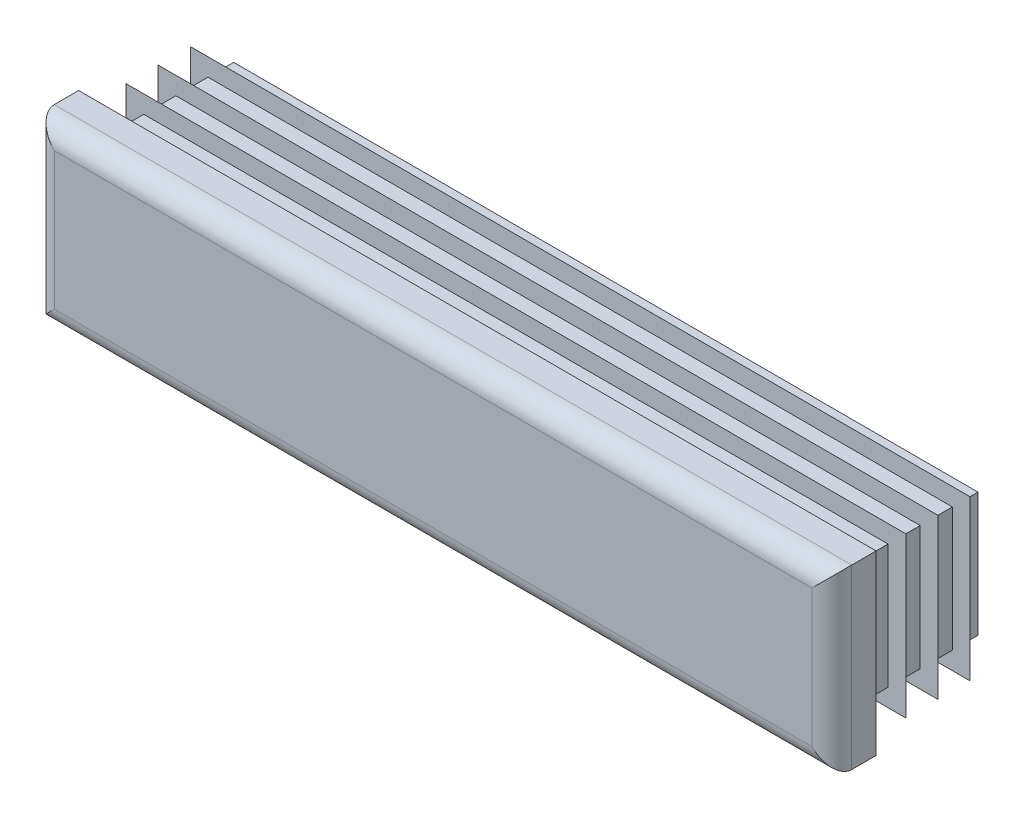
ISO-10303-21;
HEADER;
FILE_DESCRIPTION(('STEP AP214'),'2;1');
FILE_NAME('part.step','',(''),(''),'','','');
FILE_SCHEMA(('AUTOMOTIVE_DESIGN { 1 0 10303 214 1 1 1 1 }'));
ENDSEC;
DATA;
#1=APPLICATION_CONTEXT('core data for automotive mechanical design processes');
#2=APPLICATION_PROTOCOL_DEFINITION('international standard','automotive_design',2000,#1);
#3=PRODUCT_CONTEXT('',#1,'mechanical');
#4=PRODUCT('Part','Part','',(#3));
#5=PRODUCT_RELATED_PRODUCT_CATEGORY('part','',(#4));
#6=PRODUCT_DEFINITION_FORMATION('','',#4);
#7=PRODUCT_DEFINITION_CONTEXT('part definition',#1,'design');
#8=PRODUCT_DEFINITION('design','',#6,#7);
#9=PRODUCT_DEFINITION_SHAPE('','',#8);
#10=(LENGTH_UNIT() NAMED_UNIT(*) SI_UNIT(.MILLI.,.METRE.));
#11=(NAMED_UNIT(*) PLANE_ANGLE_UNIT() SI_UNIT($,.RADIAN.));
#12=(NAMED_UNIT(*) SI_UNIT($,.STERADIAN.) SOLID_ANGLE_UNIT());
#13=UNCERTAINTY_MEASURE_WITH_UNIT(LENGTH_MEASURE(1.E-05),#10,'distance_accuracy_value','');
#14=(GEOMETRIC_REPRESENTATION_CONTEXT(3) GLOBAL_UNCERTAINTY_ASSIGNED_CONTEXT((#13)) GLOBAL_UNIT_ASSIGNED_CONTEXT((#10,
#11,#12)) REPRESENTATION_CONTEXT('',''));
#15=CARTESIAN_POINT('',(0.,0.,0.));
#16=DIRECTION('',(0.,0.,1.));
#17=DIRECTION('',(1.,0.,0.));
#18=AXIS2_PLACEMENT_3D('',#15,#16,#17);
#19=CARTESIAN_POINT('',(42.75,-10.,5.));
#20=DIRECTION('',(0.,0.,-1.));
#21=DIRECTION('',(0.,1.,0.));
#22=AXIS2_PLACEMENT_3D('',#19,#20,#21);
#23=PLANE('',#22);
#24=DIRECTION('',(0.,1.,0.));
#25=VECTOR('',#24,1.);
#26=CARTESIAN_POINT('',(-42.75,-10.,5.));
#27=LINE('',#26,#25);
#28=CARTESIAN_POINT('',(-42.75,-7.75,5.));
#29=VERTEX_POINT('',#28);
#30=CARTESIAN_POINT('',(-42.75,7.75,5.));
#31=VERTEX_POINT('',#30);
#32=EDGE_CURVE('E310',#29,#31,#27,.T.);
#33=ORIENTED_EDGE('',*,*,#32,.F.);
#34=DIRECTION('',(-1.,0.,0.));
#35=VECTOR('',#34,1.);
#36=CARTESIAN_POINT('',(45.,-7.75,5.));
#37=LINE('',#36,#35);
#38=CARTESIAN_POINT('',(42.75,-7.75,5.));
#39=VERTEX_POINT('',#38);
#40=EDGE_CURVE('E482',#39,#29,#37,.T.);
#41=ORIENTED_EDGE('',*,*,#40,.F.);
#42=DIRECTION('',(0.,1.,0.));
#43=VECTOR('',#42,1.);
#44=CARTESIAN_POINT('',(42.75,-10.,5.));
#45=LINE('',#44,#43);
#46=CARTESIAN_POINT('',(42.75,7.75,5.));
#47=VERTEX_POINT('',#46);
#48=EDGE_CURVE('E305',#39,#47,#45,.T.);
#49=ORIENTED_EDGE('',*,*,#48,.T.);
#50=DIRECTION('',(-1.,0.,0.));
#51=VECTOR('',#50,1.);
#52=CARTESIAN_POINT('',(45.,7.75,5.));
#53=LINE('',#52,#51);
#54=EDGE_CURVE('E630',#47,#31,#53,.T.);
#55=ORIENTED_EDGE('',*,*,#54,.T.);
#56=EDGE_LOOP('',(#33,#41,#49,#55));
#57=FACE_BOUND('',#56,.T.);
#58=ADVANCED_FACE('F14',(#57),#23,.F.);
#59=CARTESIAN_POINT('',(-42.75,-10.,2.75));
#60=DIRECTION('',(0.,1.,0.));
#61=DIRECTION('',(-1.,0.,0.));
#62=AXIS2_PLACEMENT_3D('',#59,#60,#61);
#63=CYLINDRICAL_SURFACE('',#62,2.25);
#64=DIRECTION('',(0.,1.,0.));
#65=VECTOR('',#64,1.);
#66=CARTESIAN_POINT('',(-45.,-10.,2.75));
#67=LINE('',#66,#65);
#68=CARTESIAN_POINT('',(-45.,-10.,2.75));
#69=VERTEX_POINT('',#68);
#70=CARTESIAN_POINT('',(-45.,10.,2.75));
#71=VERTEX_POINT('',#70);
#72=EDGE_CURVE('E402',#69,#71,#67,.T.);
#73=ORIENTED_EDGE('',*,*,#72,.F.);
#74=CARTESIAN_POINT('',(-42.75,-7.75,2.75));
#75=DIRECTION('',(-0.707106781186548,0.707106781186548,0.));
#76=DIRECTION('',(0.707106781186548,0.707106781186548,0.));
#77=AXIS2_PLACEMENT_3D('',#74,#75,#76);
#78=ELLIPSE('',#77,3.18198051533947,2.25);
#79=EDGE_CURVE('E59',#69,#29,#78,.T.);
#80=ORIENTED_EDGE('',*,*,#79,.T.);
#81=ORIENTED_EDGE('',*,*,#32,.T.);
#82=CARTESIAN_POINT('',(-42.75,7.75,2.75));
#83=DIRECTION('',(0.707106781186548,0.707106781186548,0.));
#84=DIRECTION('',(-0.707106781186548,0.707106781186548,0.));
#85=AXIS2_PLACEMENT_3D('',#82,#83,#84);
#86=ELLIPSE('',#85,3.18198051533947,2.25);
#87=EDGE_CURVE('E306',#31,#71,#86,.F.);
#88=ORIENTED_EDGE('',*,*,#87,.T.);
#89=EDGE_LOOP('',(#73,#80,#81,#88));
#90=FACE_BOUND('',#89,.T.);
#91=ADVANCED_FACE('F16',(#90),#63,.T.);
#92=CARTESIAN_POINT('',(-45.,-10.,2.75));
#93=DIRECTION('',(1.,0.,0.));
#94=DIRECTION('',(0.,1.,0.));
#95=AXIS2_PLACEMENT_3D('',#92,#93,#94);
#96=PLANE('',#95);
#97=DIRECTION('',(0.,0.,-1.));
#98=VECTOR('',#97,1.);
#99=CARTESIAN_POINT('',(-45.,10.,2.75));
#100=LINE('',#99,#98);
#101=CARTESIAN_POINT('',(-45.,10.,0.));
#102=VERTEX_POINT('',#101);
#103=EDGE_CURVE('E615',#71,#102,#100,.T.);
#104=ORIENTED_EDGE('',*,*,#103,.T.);
#105=DIRECTION('',(0.,1.,0.));
#106=VECTOR('',#105,1.);
#107=CARTESIAN_POINT('',(-45.,-10.,0.));
#108=LINE('',#107,#106);
#109=CARTESIAN_POINT('',(-45.,-10.,0.));
#110=VERTEX_POINT('',#109);
#111=EDGE_CURVE('E400',#110,#102,#108,.T.);
#112=ORIENTED_EDGE('',*,*,#111,.F.);
#113=DIRECTION('',(0.,0.,-1.));
#114=VECTOR('',#113,1.);
#115=CARTESIAN_POINT('',(-45.,-10.,2.75));
#116=LINE('',#115,#114);
#117=EDGE_CURVE('E616',#69,#110,#116,.T.);
#118=ORIENTED_EDGE('',*,*,#117,.F.);
#119=ORIENTED_EDGE('',*,*,#72,.T.);
#120=EDGE_LOOP('',(#104,#112,#118,#119));
#121=FACE_BOUND('',#120,.T.);
#122=ADVANCED_FACE('F697',(#121),#96,.F.);
#123=CARTESIAN_POINT('',(-42.,-10.,0.));
#124=DIRECTION('',(1.,0.,0.));
#125=DIRECTION('',(0.,1.,0.));
#126=AXIS2_PLACEMENT_3D('',#123,#124,#125);
#127=PLANE('',#126);
#128=DIRECTION('',(0.,1.,0.));
#129=VECTOR('',#128,1.);
#130=CARTESIAN_POINT('',(-42.,-10.,0.));
#131=LINE('',#130,#129);
#132=CARTESIAN_POINT('',(-42.,-7.,0.));
#133=VERTEX_POINT('',#132);
#134=CARTESIAN_POINT('',(-42.,7.,0.));
#135=VERTEX_POINT('',#134);
#136=EDGE_CURVE('E397',#133,#135,#131,.T.);
#137=ORIENTED_EDGE('',*,*,#136,.T.);
#138=DIRECTION('',(0.,0.,-1.));
#139=VECTOR('',#138,1.);
#140=CARTESIAN_POINT('',(-42.,7.,0.));
#141=LINE('',#140,#139);
#142=CARTESIAN_POINT('',(-42.,7.,-0.725));
#143=VERTEX_POINT('',#142);
#144=EDGE_CURVE('E495',#135,#143,#141,.T.);
#145=ORIENTED_EDGE('',*,*,#144,.T.);
#146=DIRECTION('',(0.,1.,0.));
#147=VECTOR('',#146,1.);
#148=CARTESIAN_POINT('',(-42.,-10.,-0.725));
#149=LINE('',#148,#147);
#150=CARTESIAN_POINT('',(-42.,-7.,-0.725));
#151=VERTEX_POINT('',#150);
#152=EDGE_CURVE('E394',#151,#143,#149,.T.);
#153=ORIENTED_EDGE('',*,*,#152,.F.);
#154=DIRECTION('',(0.,0.,1.));
#155=VECTOR('',#154,1.);
#156=CARTESIAN_POINT('',(-42.,-7.,0.));
#157=LINE('',#156,#155);
#158=EDGE_CURVE('E489',#151,#133,#157,.T.);
#159=ORIENTED_EDGE('',*,*,#158,.T.);
#160=EDGE_LOOP('',(#137,#145,#153,#159));
#161=FACE_BOUND('',#160,.T.);
#162=ADVANCED_FACE('F787',(#161),#127,.F.);
#163=CARTESIAN_POINT('',(-44.,-10.,-0.725));
#164=DIRECTION('',(0.34202014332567,0.,0.939692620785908));
#165=DIRECTION('',(-0.939692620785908,0.,0.34202014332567));
#166=AXIS2_PLACEMENT_3D('',#163,#164,#165);
#167=PLANE('',#166);
#168=DIRECTION('',(0.,1.,0.));
#169=VECTOR('',#168,1.);
#170=CARTESIAN_POINT('',(-44.,-10.,-0.725));
#171=LINE('',#170,#169);
#172=CARTESIAN_POINT('',(-44.,-9.,-0.725));
#173=VERTEX_POINT('',#172);
#174=CARTESIAN_POINT('',(-44.,9.,-0.725));
#175=VERTEX_POINT('',#174);
#176=EDGE_CURVE('E392',#173,#175,#171,.T.);
#177=ORIENTED_EDGE('',*,*,#176,.T.);
#178=DIRECTION('',(0.844349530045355,-0.438895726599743,-0.307318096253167));
#179=VECTOR('',#178,1.);
#180=CARTESIAN_POINT('',(-36.9589533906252,5.3400402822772,-3.28773138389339));
#181=LINE('',#180,#179);
#182=CARTESIAN_POINT('',(-42.,7.96039327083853,-1.4529404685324));
#183=VERTEX_POINT('',#182);
#184=EDGE_CURVE('E519',#175,#183,#181,.T.);
#185=ORIENTED_EDGE('',*,*,#184,.T.);
#186=DIRECTION('',(0.,1.,0.));
#187=VECTOR('',#186,1.);
#188=CARTESIAN_POINT('',(-42.,-10.,-1.4529404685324));
#189=LINE('',#188,#187);
#190=CARTESIAN_POINT('',(-42.,-7.96039327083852,-1.4529404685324));
#191=VERTEX_POINT('',#190);
#192=EDGE_CURVE('E389',#191,#183,#189,.T.);
#193=ORIENTED_EDGE('',*,*,#192,.F.);
#194=DIRECTION('',(-0.844349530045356,-0.438895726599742,0.307318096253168));
#195=VECTOR('',#194,1.);
#196=CARTESIAN_POINT('',(-44.3705814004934,-9.19262945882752,-0.590119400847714));
#197=LINE('',#196,#195);
#198=EDGE_CURVE('E507',#191,#173,#197,.T.);
#199=ORIENTED_EDGE('',*,*,#198,.T.);
#200=EDGE_LOOP('',(#177,#185,#193,#199));
#201=FACE_BOUND('',#200,.T.);
#202=ADVANCED_FACE('F783',(#201),#167,.F.);
#203=CARTESIAN_POINT('',(-42.,-10.,-1.4529404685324));
#204=DIRECTION('',(1.,0.,0.));
#205=DIRECTION('',(0.,1.,0.));
#206=AXIS2_PLACEMENT_3D('',#203,#204,#205);
#207=PLANE('',#206);
#208=ORIENTED_EDGE('',*,*,#192,.T.);
#209=DIRECTION('',(0.,-0.819152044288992,-0.573576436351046));
#210=VECTOR('',#209,1.);
#211=CARTESIAN_POINT('',(-42.,-4.09121150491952,-9.89156498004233));
#212=LINE('',#211,#210);
#213=CARTESIAN_POINT('',(-42.,7.,-2.12541507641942));
#214=VERTEX_POINT('',#213);
#215=EDGE_CURVE('E516',#183,#214,#212,.T.);
#216=ORIENTED_EDGE('',*,*,#215,.T.);
#217=DIRECTION('',(0.,0.,-1.));
#218=VECTOR('',#217,1.);
#219=CARTESIAN_POINT('',(-42.,7.,-1.4529404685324));
#220=LINE('',#219,#218);
#221=CARTESIAN_POINT('',(-42.,7.,-4.35));
#222=VERTEX_POINT('',#221);
#223=EDGE_CURVE('E525',#214,#222,#220,.T.);
#224=ORIENTED_EDGE('',*,*,#223,.T.);
#225=DIRECTION('',(0.,1.,0.));
#226=VECTOR('',#225,1.);
#227=CARTESIAN_POINT('',(-42.,-10.,-4.35));
#228=LINE('',#227,#226);
#229=CARTESIAN_POINT('',(-42.,-7.,-4.35));
#230=VERTEX_POINT('',#229);
#231=EDGE_CURVE('E386',#230,#222,#228,.T.);
#232=ORIENTED_EDGE('',*,*,#231,.F.);
#233=DIRECTION('',(0.,0.,1.));
#234=VECTOR('',#233,1.);
#235=CARTESIAN_POINT('',(-42.,-7.,-1.4529404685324));
#236=LINE('',#235,#234);
#237=CARTESIAN_POINT('',(-42.,-7.,-2.12541507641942));
#238=VERTEX_POINT('',#237);
#239=EDGE_CURVE('E522',#230,#238,#236,.T.);
#240=ORIENTED_EDGE('',*,*,#239,.T.);
#241=DIRECTION('',(0.,-0.819152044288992,0.573576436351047));
#242=VECTOR('',#241,1.);
#243=CARTESIAN_POINT('',(-42.,-9.32898992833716,-0.494638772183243));
#244=LINE('',#243,#242);
#245=EDGE_CURVE('E504',#238,#191,#244,.T.);
#246=ORIENTED_EDGE('',*,*,#245,.T.);
#247=EDGE_LOOP('',(#208,#216,#224,#232,#240,#246));
#248=FACE_BOUND('',#247,.T.);
#249=ADVANCED_FACE('F779',(#248),#207,.F.);
#250=CARTESIAN_POINT('',(-44.,-10.,-4.35));
#251=DIRECTION('',(0.342020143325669,0.,0.939692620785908));
#252=DIRECTION('',(-0.939692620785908,0.,0.342020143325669));
#253=AXIS2_PLACEMENT_3D('',#250,#251,#252);
#254=PLANE('',#253);
#255=DIRECTION('',(0.,1.,0.));
#256=VECTOR('',#255,1.);
#257=CARTESIAN_POINT('',(-44.,-10.,-4.35));
#258=LINE('',#257,#256);
#259=CARTESIAN_POINT('',(-44.,-9.,-4.35));
#260=VERTEX_POINT('',#259);
#261=CARTESIAN_POINT('',(-44.,9.,-4.35));
#262=VERTEX_POINT('',#261);
#263=EDGE_CURVE('E384',#260,#262,#258,.T.);
#264=ORIENTED_EDGE('',*,*,#263,.T.);
#265=DIRECTION('',(0.844349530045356,-0.438895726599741,-0.307318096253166));
#266=VECTOR('',#265,1.);
#267=CARTESIAN_POINT('',(-36.9589533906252,5.34004028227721,-6.91273138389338));
#268=LINE('',#267,#266);
#269=CARTESIAN_POINT('',(-42.,7.96039327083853,-5.0779404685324));
#270=VERTEX_POINT('',#269);
#271=EDGE_CURVE('E549',#262,#270,#268,.T.);
#272=ORIENTED_EDGE('',*,*,#271,.T.);
#273=DIRECTION('',(0.,1.,0.));
#274=VECTOR('',#273,1.);
#275=CARTESIAN_POINT('',(-42.,-10.,-5.0779404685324));
#276=LINE('',#275,#274);
#277=CARTESIAN_POINT('',(-42.,-7.96039327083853,-5.0779404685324));
#278=VERTEX_POINT('',#277);
#279=EDGE_CURVE('E381',#278,#270,#276,.T.);
#280=ORIENTED_EDGE('',*,*,#279,.F.);
#281=DIRECTION('',(-0.844349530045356,-0.438895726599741,0.307318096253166));
#282=VECTOR('',#281,1.);
#283=CARTESIAN_POINT('',(-44.3705814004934,-9.19262945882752,-4.21511940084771));
#284=LINE('',#283,#282);
#285=EDGE_CURVE('E537',#278,#260,#284,.T.);
#286=ORIENTED_EDGE('',*,*,#285,.T.);
#287=EDGE_LOOP('',(#264,#272,#280,#286));
#288=FACE_BOUND('',#287,.T.);
#289=ADVANCED_FACE('F775',(#288),#254,.F.);
#290=CARTESIAN_POINT('',(-42.,-10.,-5.0779404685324));
#291=DIRECTION('',(1.,0.,0.));
#292=DIRECTION('',(0.,1.,0.));
#293=AXIS2_PLACEMENT_3D('',#290,#291,#292);
#294=PLANE('',#293);
#295=ORIENTED_EDGE('',*,*,#279,.T.);
#296=DIRECTION('',(0.,-0.819152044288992,-0.573576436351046));
#297=VECTOR('',#296,1.);
#298=CARTESIAN_POINT('',(-42.,-4.09121150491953,-13.5165649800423));
#299=LINE('',#298,#297);
#300=CARTESIAN_POINT('',(-42.,7.,-5.75041507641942));
#301=VERTEX_POINT('',#300);
#302=EDGE_CURVE('E546',#270,#301,#299,.T.);
#303=ORIENTED_EDGE('',*,*,#302,.T.);
#304=DIRECTION('',(0.,0.,-1.));
#305=VECTOR('',#304,1.);
#306=CARTESIAN_POINT('',(-42.,7.,-5.0779404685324));
#307=LINE('',#306,#305);
#308=CARTESIAN_POINT('',(-42.,7.,-7.975));
#309=VERTEX_POINT('',#308);
#310=EDGE_CURVE('E555',#301,#309,#307,.T.);
#311=ORIENTED_EDGE('',*,*,#310,.T.);
#312=DIRECTION('',(0.,1.,0.));
#313=VECTOR('',#312,1.);
#314=CARTESIAN_POINT('',(-42.,-10.,-7.975));
#315=LINE('',#314,#313);
#316=CARTESIAN_POINT('',(-42.,-7.,-7.975));
#317=VERTEX_POINT('',#316);
#318=EDGE_CURVE('E378',#317,#309,#315,.T.);
#319=ORIENTED_EDGE('',*,*,#318,.F.);
#320=DIRECTION('',(0.,0.,1.));
#321=VECTOR('',#320,1.);
#322=CARTESIAN_POINT('',(-42.,-7.,-5.0779404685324));
#323=LINE('',#322,#321);
#324=CARTESIAN_POINT('',(-42.,-7.,-5.75041507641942));
#325=VERTEX_POINT('',#324);
#326=EDGE_CURVE('E552',#317,#325,#323,.T.);
#327=ORIENTED_EDGE('',*,*,#326,.T.);
#328=DIRECTION('',(0.,-0.819152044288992,0.573576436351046));
#329=VECTOR('',#328,1.);
#330=CARTESIAN_POINT('',(-42.,-9.32898992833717,-4.11963877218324));
#331=LINE('',#330,#329);
#332=EDGE_CURVE('E534',#325,#278,#331,.T.);
#333=ORIENTED_EDGE('',*,*,#332,.T.);
#334=EDGE_LOOP('',(#295,#303,#311,#319,#327,#333));
#335=FACE_BOUND('',#334,.T.);
#336=ADVANCED_FACE('F771',(#335),#294,.F.);
#337=CARTESIAN_POINT('',(-44.,-10.,-7.975));
#338=DIRECTION('',(0.342020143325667,0.,0.939692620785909));
#339=DIRECTION('',(-0.939692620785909,0.,0.342020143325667));
#340=AXIS2_PLACEMENT_3D('',#337,#338,#339);
#341=PLANE('',#340);
#342=DIRECTION('',(0.,1.,0.));
#343=VECTOR('',#342,1.);
#344=CARTESIAN_POINT('',(-44.,-10.,-7.975));
#345=LINE('',#344,#343);
#346=CARTESIAN_POINT('',(-44.,-9.,-7.975));
#347=VERTEX_POINT('',#346);
#348=CARTESIAN_POINT('',(-44.,9.,-7.975));
#349=VERTEX_POINT('',#348);
#350=EDGE_CURVE('E376',#347,#349,#345,.T.);
#351=ORIENTED_EDGE('',*,*,#350,.T.);
#352=DIRECTION('',(0.844349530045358,-0.43889572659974,-0.307318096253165));
#353=VECTOR('',#352,1.);
#354=CARTESIAN_POINT('',(-36.9589533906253,5.34004028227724,-10.5377313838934));
#355=LINE('',#354,#353);
#356=CARTESIAN_POINT('',(-42.,7.96039327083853,-8.7029404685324));
#357=VERTEX_POINT('',#356);
#358=EDGE_CURVE('E579',#349,#357,#355,.T.);
#359=ORIENTED_EDGE('',*,*,#358,.T.);
#360=DIRECTION('',(0.,1.,0.));
#361=VECTOR('',#360,1.);
#362=CARTESIAN_POINT('',(-42.,-10.,-8.7029404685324));
#363=LINE('',#362,#361);
#364=CARTESIAN_POINT('',(-42.,-7.96039327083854,-8.7029404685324));
#365=VERTEX_POINT('',#364);
#366=EDGE_CURVE('E373',#365,#357,#363,.T.);
#367=ORIENTED_EDGE('',*,*,#366,.F.);
#368=DIRECTION('',(-0.844349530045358,-0.438895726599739,0.307318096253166));
#369=VECTOR('',#368,1.);
#370=CARTESIAN_POINT('',(-44.3705814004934,-9.19262945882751,-7.84011940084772));
#371=LINE('',#370,#369);
#372=EDGE_CURVE('E567',#365,#347,#371,.T.);
#373=ORIENTED_EDGE('',*,*,#372,.T.);
#374=EDGE_LOOP('',(#351,#359,#367,#373));
#375=FACE_BOUND('',#374,.T.);
#376=ADVANCED_FACE('F767',(#375),#341,.F.);
#377=CARTESIAN_POINT('',(-42.,-10.,-8.7029404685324));
#378=DIRECTION('',(1.,0.,0.));
#379=DIRECTION('',(0.,1.,0.));
#380=AXIS2_PLACEMENT_3D('',#377,#378,#379);
#381=PLANE('',#380);
#382=ORIENTED_EDGE('',*,*,#366,.T.);
#383=DIRECTION('',(0.,-0.819152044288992,-0.573576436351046));
#384=VECTOR('',#383,1.);
#385=CARTESIAN_POINT('',(-42.,-4.09121150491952,-17.1415649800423));
#386=LINE('',#385,#384);
#387=CARTESIAN_POINT('',(-42.,7.,-9.37541507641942));
#388=VERTEX_POINT('',#387);
#389=EDGE_CURVE('E576',#357,#388,#386,.T.);
#390=ORIENTED_EDGE('',*,*,#389,.T.);
#391=DIRECTION('',(0.,0.,-1.));
#392=VECTOR('',#391,1.);
#393=CARTESIAN_POINT('',(-42.,7.,-8.7029404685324));
#394=LINE('',#393,#392);
#395=CARTESIAN_POINT('',(-42.,7.,-11.6));
#396=VERTEX_POINT('',#395);
#397=EDGE_CURVE('E585',#388,#396,#394,.T.);
#398=ORIENTED_EDGE('',*,*,#397,.T.);
#399=DIRECTION('',(0.,1.,0.));
#400=VECTOR('',#399,1.);
#401=CARTESIAN_POINT('',(-42.,-10.,-11.6));
#402=LINE('',#401,#400);
#403=CARTESIAN_POINT('',(-42.,-7.,-11.6));
#404=VERTEX_POINT('',#403);
#405=EDGE_CURVE('E370',#404,#396,#402,.T.);
#406=ORIENTED_EDGE('',*,*,#405,.F.);
#407=DIRECTION('',(0.,0.,1.));
#408=VECTOR('',#407,1.);
#409=CARTESIAN_POINT('',(-42.,-7.,-8.7029404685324));
#410=LINE('',#409,#408);
#411=CARTESIAN_POINT('',(-42.,-7.,-9.37541507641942));
#412=VERTEX_POINT('',#411);
#413=EDGE_CURVE('E582',#404,#412,#410,.T.);
#414=ORIENTED_EDGE('',*,*,#413,.T.);
#415=DIRECTION('',(0.,-0.819152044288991,0.573576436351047));
#416=VECTOR('',#415,1.);
#417=CARTESIAN_POINT('',(-42.,-9.32898992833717,-7.74463877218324));
#418=LINE('',#417,#416);
#419=EDGE_CURVE('E564',#412,#365,#418,.T.);
#420=ORIENTED_EDGE('',*,*,#419,.T.);
#421=EDGE_LOOP('',(#382,#390,#398,#406,#414,#420));
#422=FACE_BOUND('',#421,.T.);
#423=ADVANCED_FACE('F764',(#422),#381,.F.);
#424=CARTESIAN_POINT('',(-44.,-10.,-11.6));
#425=DIRECTION('',(0.342020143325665,0.,0.93969262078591));
#426=DIRECTION('',(-0.93969262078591,0.,0.342020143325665));
#427=AXIS2_PLACEMENT_3D('',#424,#425,#426);
#428=PLANE('',#427);
#429=DIRECTION('',(0.,1.,0.));
#430=VECTOR('',#429,1.);
#431=CARTESIAN_POINT('',(-44.,-10.,-11.6));
#432=LINE('',#431,#430);
#433=CARTESIAN_POINT('',(-44.,-9.,-11.6));
#434=VERTEX_POINT('',#433);
#435=CARTESIAN_POINT('',(-44.,9.,-11.6));
#436=VERTEX_POINT('',#435);
#437=EDGE_CURVE('E368',#434,#436,#432,.T.);
#438=ORIENTED_EDGE('',*,*,#437,.T.);
#439=DIRECTION('',(0.844349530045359,-0.438895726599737,-0.307318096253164));
#440=VECTOR('',#439,1.);
#441=CARTESIAN_POINT('',(-36.9589533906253,5.34004028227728,-14.1627313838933));
#442=LINE('',#441,#440);
#443=CARTESIAN_POINT('',(-42.,7.96039327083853,-12.3279404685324));
#444=VERTEX_POINT('',#443);
#445=EDGE_CURVE('E607',#436,#444,#442,.T.);
#446=ORIENTED_EDGE('',*,*,#445,.T.);
#447=DIRECTION('',(0.,1.,0.));
#448=VECTOR('',#447,1.);
#449=CARTESIAN_POINT('',(-42.,-10.,-12.3279404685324));
#450=LINE('',#449,#448);
#451=CARTESIAN_POINT('',(-42.,-7.96039327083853,-12.3279404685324));
#452=VERTEX_POINT('',#451);
#453=EDGE_CURVE('E365',#452,#444,#450,.T.);
#454=ORIENTED_EDGE('',*,*,#453,.F.);
#455=DIRECTION('',(-0.844349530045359,-0.438895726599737,0.307318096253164));
#456=VECTOR('',#455,1.);
#457=CARTESIAN_POINT('',(-44.3705814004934,-9.19262945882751,-11.4651194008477));
#458=LINE('',#457,#456);
#459=EDGE_CURVE('E595',#452,#434,#458,.T.);
#460=ORIENTED_EDGE('',*,*,#459,.T.);
#461=EDGE_LOOP('',(#438,#446,#454,#460));
#462=FACE_BOUND('',#461,.T.);
#463=ADVANCED_FACE('F675',(#462),#428,.F.);
#464=CARTESIAN_POINT('',(-42.,-10.,-12.3279404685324));
#465=DIRECTION('',(1.,0.,0.));
#466=DIRECTION('',(0.,1.,0.));
#467=AXIS2_PLACEMENT_3D('',#464,#465,#466);
#468=PLANE('',#467);
#469=ORIENTED_EDGE('',*,*,#453,.T.);
#470=DIRECTION('',(0.,-0.819152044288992,-0.573576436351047));
#471=VECTOR('',#470,1.);
#472=CARTESIAN_POINT('',(-42.,-4.09121150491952,-20.7665649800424));
#473=LINE('',#472,#471);
#474=CARTESIAN_POINT('',(-42.,7.,-13.0004150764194));
#475=VERTEX_POINT('',#474);
#476=EDGE_CURVE('E604',#444,#475,#473,.T.);
#477=ORIENTED_EDGE('',*,*,#476,.T.);
#478=DIRECTION('',(0.,0.,-1.));
#479=VECTOR('',#478,1.);
#480=CARTESIAN_POINT('',(-42.,7.,-12.3279404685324));
#481=LINE('',#480,#479);
#482=CARTESIAN_POINT('',(-42.,7.,-14.5));
#483=VERTEX_POINT('',#482);
#484=EDGE_CURVE('E613',#475,#483,#481,.T.);
#485=ORIENTED_EDGE('',*,*,#484,.T.);
#486=DIRECTION('',(0.,1.,0.));
#487=VECTOR('',#486,1.);
#488=CARTESIAN_POINT('',(-42.,-10.,-14.5));
#489=LINE('',#488,#487);
#490=CARTESIAN_POINT('',(-42.,-7.,-14.5));
#491=VERTEX_POINT('',#490);
#492=EDGE_CURVE('E362',#491,#483,#489,.T.);
#493=ORIENTED_EDGE('',*,*,#492,.F.);
#494=DIRECTION('',(0.,0.,1.));
#495=VECTOR('',#494,1.);
#496=CARTESIAN_POINT('',(-42.,-7.,-12.3279404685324));
#497=LINE('',#496,#495);
#498=CARTESIAN_POINT('',(-42.,-7.,-13.0004150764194));
#499=VERTEX_POINT('',#498);
#500=EDGE_CURVE('E610',#491,#499,#497,.T.);
#501=ORIENTED_EDGE('',*,*,#500,.T.);
#502=DIRECTION('',(0.,-0.819152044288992,0.573576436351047));
#503=VECTOR('',#502,1.);
#504=CARTESIAN_POINT('',(-42.,-9.32898992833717,-11.3696387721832));
#505=LINE('',#504,#503);
#506=EDGE_CURVE('E592',#499,#452,#505,.T.);
#507=ORIENTED_EDGE('',*,*,#506,.T.);
#508=EDGE_LOOP('',(#469,#477,#485,#493,#501,#507));
#509=FACE_BOUND('',#508,.T.);
#510=ADVANCED_FACE('F677',(#509),#468,.F.);
#511=CARTESIAN_POINT('',(-42.,-10.,-14.5));
#512=DIRECTION('',(0.,0.,1.));
#513=DIRECTION('',(0.,-1.,0.));
#514=AXIS2_PLACEMENT_3D('',#511,#512,#513);
#515=PLANE('',#514);
#516=ORIENTED_EDGE('',*,*,#492,.T.);
#517=DIRECTION('',(-1.,0.,0.));
#518=VECTOR('',#517,1.);
#519=CARTESIAN_POINT('',(45.,7.,-14.5));
#520=LINE('',#519,#518);
#521=CARTESIAN_POINT('',(42.,7.,-14.5));
#522=VERTEX_POINT('',#521);
#523=EDGE_CURVE('E438',#522,#483,#520,.T.);
#524=ORIENTED_EDGE('',*,*,#523,.F.);
#525=DIRECTION('',(0.,1.,0.));
#526=VECTOR('',#525,1.);
#527=CARTESIAN_POINT('',(42.,-10.,-14.5));
#528=LINE('',#527,#526);
#529=CARTESIAN_POINT('',(42.,-7.,-14.5));
#530=VERTEX_POINT('',#529);
#531=EDGE_CURVE('E359',#530,#522,#528,.T.);
#532=ORIENTED_EDGE('',*,*,#531,.F.);
#533=DIRECTION('',(-1.,0.,0.));
#534=VECTOR('',#533,1.);
#535=CARTESIAN_POINT('',(45.,-7.,-14.5));
#536=LINE('',#535,#534);
#537=EDGE_CURVE('E436',#530,#491,#536,.T.);
#538=ORIENTED_EDGE('',*,*,#537,.T.);
#539=EDGE_LOOP('',(#516,#524,#532,#538));
#540=FACE_BOUND('',#539,.T.);
#541=ADVANCED_FACE('F435',(#540),#515,.F.);
#542=CARTESIAN_POINT('',(42.,-10.,-14.5));
#543=DIRECTION('',(-1.,0.,0.));
#544=DIRECTION('',(0.,-1.,0.));
#545=AXIS2_PLACEMENT_3D('',#542,#543,#544);
#546=PLANE('',#545);
#547=DIRECTION('',(0.,0.,1.));
#548=VECTOR('',#547,1.);
#549=CARTESIAN_POINT('',(42.,7.,-14.5));
#550=LINE('',#549,#548);
#551=CARTESIAN_POINT('',(42.,7.,-13.0004150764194));
#552=VERTEX_POINT('',#551);
#553=EDGE_CURVE('E9',#522,#552,#550,.T.);
#554=ORIENTED_EDGE('',*,*,#553,.T.);
#555=DIRECTION('',(0.,0.819152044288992,0.573576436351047));
#556=VECTOR('',#555,1.);
#557=CARTESIAN_POINT('',(42.,-5.11174566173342,-21.4811506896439));
#558=LINE('',#557,#556);
#559=CARTESIAN_POINT('',(42.,7.96039327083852,-12.3279404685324));
#560=VERTEX_POINT('',#559);
#561=EDGE_CURVE('E601',#552,#560,#558,.T.);
#562=ORIENTED_EDGE('',*,*,#561,.T.);
#563=DIRECTION('',(0.,1.,0.));
#564=VECTOR('',#563,1.);
#565=CARTESIAN_POINT('',(42.,-10.,-12.3279404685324));
#566=LINE('',#565,#564);
#567=CARTESIAN_POINT('',(42.,-7.96039327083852,-12.3279404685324));
#568=VERTEX_POINT('',#567);
#569=EDGE_CURVE('E356',#568,#560,#566,.T.);
#570=ORIENTED_EDGE('',*,*,#569,.F.);
#571=DIRECTION('',(0.,0.819152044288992,-0.573576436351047));
#572=VECTOR('',#571,1.);
#573=CARTESIAN_POINT('',(42.,-8.30845577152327,-12.0842244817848));
#574=LINE('',#573,#572);
#575=CARTESIAN_POINT('',(42.,-7.,-13.0004150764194));
#576=VERTEX_POINT('',#575);
#577=EDGE_CURVE('E428',#568,#576,#574,.T.);
#578=ORIENTED_EDGE('',*,*,#577,.T.);
#579=DIRECTION('',(0.,0.,-1.));
#580=VECTOR('',#579,1.);
#581=CARTESIAN_POINT('',(42.,-7.,-14.5));
#582=LINE('',#581,#580);
#583=EDGE_CURVE('E23',#576,#530,#582,.T.);
#584=ORIENTED_EDGE('',*,*,#583,.T.);
#585=ORIENTED_EDGE('',*,*,#531,.T.);
#586=EDGE_LOOP('',(#554,#562,#570,#578,#584,#585));
#587=FACE_BOUND('',#586,.T.);
#588=ADVANCED_FACE('F426',(#587),#546,.F.);
#589=CARTESIAN_POINT('',(42.,-10.,-12.3279404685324));
#590=DIRECTION('',(-0.342020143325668,0.,0.939692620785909));
#591=DIRECTION('',(-0.939692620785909,0.,-0.342020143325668));
#592=AXIS2_PLACEMENT_3D('',#589,#590,#591);
#593=PLANE('',#592);
#594=ORIENTED_EDGE('',*,*,#569,.T.);
#595=DIRECTION('',(0.844349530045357,0.43889572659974,0.307318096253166));
#596=VECTOR('',#595,1.);
#597=CARTESIAN_POINT('',(35.3442123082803,4.50069243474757,-14.7504490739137));
#598=LINE('',#597,#596);
#599=CARTESIAN_POINT('',(44.,9.,-11.6));
#600=VERTEX_POINT('',#599);
#601=EDGE_CURVE('E598',#560,#600,#598,.T.);
#602=ORIENTED_EDGE('',*,*,#601,.T.);
#603=DIRECTION('',(0.,1.,0.));
#604=VECTOR('',#603,1.);
#605=CARTESIAN_POINT('',(44.,-10.,-11.6));
#606=LINE('',#605,#604);
#607=CARTESIAN_POINT('',(44.,-9.,-11.6));
#608=VERTEX_POINT('',#607);
#609=EDGE_CURVE('E353',#608,#600,#606,.T.);
#610=ORIENTED_EDGE('',*,*,#609,.F.);
#611=DIRECTION('',(-0.844349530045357,0.43889572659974,-0.307318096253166));
#612=VECTOR('',#611,1.);
#613=CARTESIAN_POINT('',(42.7558403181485,-8.35328161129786,-12.0528370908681));
#614=LINE('',#613,#612);
#615=EDGE_CURVE('E588',#608,#568,#614,.T.);
#616=ORIENTED_EDGE('',*,*,#615,.T.);
#617=EDGE_LOOP('',(#594,#602,#610,#616));
#618=FACE_BOUND('',#617,.T.);
#619=ADVANCED_FACE('F752',(#618),#593,.F.);
#620=CARTESIAN_POINT('',(44.,-10.,-11.6));
#621=DIRECTION('',(0.,0.,-1.));
#622=DIRECTION('',(0.,1.,0.));
#623=AXIS2_PLACEMENT_3D('',#620,#621,#622);
#624=PLANE('',#623);
#625=ORIENTED_EDGE('',*,*,#609,.T.);
#626=DIRECTION('',(-1.,0.,0.));
#627=VECTOR('',#626,1.);
#628=CARTESIAN_POINT('',(45.,9.,-11.6));
#629=LINE('',#628,#627);
#630=EDGE_CURVE('E444',#600,#436,#629,.T.);
#631=ORIENTED_EDGE('',*,*,#630,.T.);
#632=ORIENTED_EDGE('',*,*,#437,.F.);
#633=DIRECTION('',(-1.,0.,0.));
#634=VECTOR('',#633,1.);
#635=CARTESIAN_POINT('',(45.,-9.,-11.6));
#636=LINE('',#635,#634);
#637=EDGE_CURVE('E451',#608,#434,#636,.T.);
#638=ORIENTED_EDGE('',*,*,#637,.F.);
#639=EDGE_LOOP('',(#625,#631,#632,#638));
#640=FACE_BOUND('',#639,.T.);
#641=ORIENTED_EDGE('',*,*,#405,.T.);
#642=DIRECTION('',(-1.,0.,0.));
#643=VECTOR('',#642,1.);
#644=CARTESIAN_POINT('',(45.,7.,-11.6));
#645=LINE('',#644,#643);
#646=CARTESIAN_POINT('',(42.,7.,-11.6));
#647=VERTEX_POINT('',#646);
#648=EDGE_CURVE('E663',#647,#396,#645,.T.);
#649=ORIENTED_EDGE('',*,*,#648,.F.);
#650=DIRECTION('',(0.,1.,0.));
#651=VECTOR('',#650,1.);
#652=CARTESIAN_POINT('',(42.,-10.,-11.6));
#653=LINE('',#652,#651);
#654=CARTESIAN_POINT('',(42.,-7.,-11.6));
#655=VERTEX_POINT('',#654);
#656=EDGE_CURVE('E350',#655,#647,#653,.T.);
#657=ORIENTED_EDGE('',*,*,#656,.F.);
#658=DIRECTION('',(-1.,0.,0.));
#659=VECTOR('',#658,1.);
#660=CARTESIAN_POINT('',(45.,-7.,-11.6));
#661=LINE('',#660,#659);
#662=EDGE_CURVE('E453',#655,#404,#661,.T.);
#663=ORIENTED_EDGE('',*,*,#662,.T.);
#664=EDGE_LOOP('',(#641,#649,#657,#663));
#665=FACE_BOUND('',#664,.T.);
#666=ADVANCED_FACE('F667',(#640,#665),#624,.F.);
#667=CARTESIAN_POINT('',(42.,-10.,-11.6));
#668=DIRECTION('',(-1.,0.,0.));
#669=DIRECTION('',(0.,-1.,0.));
#670=AXIS2_PLACEMENT_3D('',#667,#668,#669);
#671=PLANE('',#670);
#672=DIRECTION('',(0.,0.,1.));
#673=VECTOR('',#672,1.);
#674=CARTESIAN_POINT('',(42.,7.,-11.6));
#675=LINE('',#674,#673);
#676=CARTESIAN_POINT('',(42.,7.,-9.37541507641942));
#677=VERTEX_POINT('',#676);
#678=EDGE_CURVE('E420',#647,#677,#675,.T.);
#679=ORIENTED_EDGE('',*,*,#678,.T.);
#680=DIRECTION('',(0.,0.819152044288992,0.573576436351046));
#681=VECTOR('',#680,1.);
#682=CARTESIAN_POINT('',(42.,-5.45238423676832,-18.0946683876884));
#683=LINE('',#682,#681);
#684=CARTESIAN_POINT('',(42.,7.96039327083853,-8.7029404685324));
#685=VERTEX_POINT('',#684);
#686=EDGE_CURVE('E573',#677,#685,#683,.T.);
#687=ORIENTED_EDGE('',*,*,#686,.T.);
#688=DIRECTION('',(0.,1.,0.));
#689=VECTOR('',#688,1.);
#690=CARTESIAN_POINT('',(42.,-10.,-8.70294046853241));
#691=LINE('',#690,#689);
#692=CARTESIAN_POINT('',(42.,-7.96039327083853,-8.70294046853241));
#693=VERTEX_POINT('',#692);
#694=EDGE_CURVE('E347',#693,#685,#691,.T.);
#695=ORIENTED_EDGE('',*,*,#694,.F.);
#696=DIRECTION('',(0.,0.819152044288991,-0.573576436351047));
#697=VECTOR('',#696,1.);
#698=CARTESIAN_POINT('',(42.,-7.96781719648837,-8.69774217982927));
#699=LINE('',#698,#697);
#700=CARTESIAN_POINT('',(42.,-7.,-9.37541507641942));
#701=VERTEX_POINT('',#700);
#702=EDGE_CURVE('E561',#693,#701,#699,.T.);
#703=ORIENTED_EDGE('',*,*,#702,.T.);
#704=DIRECTION('',(0.,0.,-1.));
#705=VECTOR('',#704,1.);
#706=CARTESIAN_POINT('',(42.,-7.,-11.6));
#707=LINE('',#706,#705);
#708=EDGE_CURVE('E417',#701,#655,#707,.T.);
#709=ORIENTED_EDGE('',*,*,#708,.T.);
#710=ORIENTED_EDGE('',*,*,#656,.T.);
#711=EDGE_LOOP('',(#679,#687,#695,#703,#709,#710));
#712=FACE_BOUND('',#711,.T.);
#713=ADVANCED_FACE('F745',(#712),#671,.F.);
#714=CARTESIAN_POINT('',(42.,-10.,-8.70294046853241));
#715=DIRECTION('',(-0.34202014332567,0.,0.939692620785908));
#716=DIRECTION('',(-0.939692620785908,0.,-0.34202014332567));
#717=AXIS2_PLACEMENT_3D('',#714,#715,#716);
#718=PLANE('',#717);
#719=ORIENTED_EDGE('',*,*,#694,.T.);
#720=DIRECTION('',(0.844349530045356,0.438895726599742,0.307318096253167));
#721=VECTOR('',#720,1.);
#722=CARTESIAN_POINT('',(35.3442123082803,4.50069243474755,-11.1254490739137));
#723=LINE('',#722,#721);
#724=CARTESIAN_POINT('',(44.,9.,-7.975));
#725=VERTEX_POINT('',#724);
#726=EDGE_CURVE('E570',#685,#725,#723,.T.);
#727=ORIENTED_EDGE('',*,*,#726,.T.);
#728=DIRECTION('',(0.,1.,0.));
#729=VECTOR('',#728,1.);
#730=CARTESIAN_POINT('',(44.,-10.,-7.975));
#731=LINE('',#730,#729);
#732=CARTESIAN_POINT('',(44.,-9.,-7.975));
#733=VERTEX_POINT('',#732);
#734=EDGE_CURVE('E344',#733,#725,#731,.T.);
#735=ORIENTED_EDGE('',*,*,#734,.F.);
#736=DIRECTION('',(-0.844349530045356,0.438895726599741,-0.307318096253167));
#737=VECTOR('',#736,1.);
#738=CARTESIAN_POINT('',(42.7558403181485,-8.35328161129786,-8.42783709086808));
#739=LINE('',#738,#737);
#740=EDGE_CURVE('E558',#733,#693,#739,.T.);
#741=ORIENTED_EDGE('',*,*,#740,.T.);
#742=EDGE_LOOP('',(#719,#727,#735,#741));
#743=FACE_BOUND('',#742,.T.);
#744=ADVANCED_FACE('F741',(#743),#718,.F.);
#745=CARTESIAN_POINT('',(44.,-10.,-7.975));
#746=DIRECTION('',(0.,0.,-1.));
#747=DIRECTION('',(0.,1.,0.));
#748=AXIS2_PLACEMENT_3D('',#745,#746,#747);
#749=PLANE('',#748);
#750=ORIENTED_EDGE('',*,*,#734,.T.);
#751=DIRECTION('',(-1.,0.,0.));
#752=VECTOR('',#751,1.);
#753=CARTESIAN_POINT('',(45.,9.,-7.975));
#754=LINE('',#753,#752);
#755=EDGE_CURVE('E657',#725,#349,#754,.T.);
#756=ORIENTED_EDGE('',*,*,#755,.T.);
#757=ORIENTED_EDGE('',*,*,#350,.F.);
#758=DIRECTION('',(-1.,0.,0.));
#759=VECTOR('',#758,1.);
#760=CARTESIAN_POINT('',(45.,-9.,-7.975));
#761=LINE('',#760,#759);
#762=EDGE_CURVE('E459',#733,#347,#761,.T.);
#763=ORIENTED_EDGE('',*,*,#762,.F.);
#764=EDGE_LOOP('',(#750,#756,#757,#763));
#765=FACE_BOUND('',#764,.T.);
#766=ORIENTED_EDGE('',*,*,#318,.T.);
#767=DIRECTION('',(-1.,0.,0.));
#768=VECTOR('',#767,1.);
#769=CARTESIAN_POINT('',(45.,7.,-7.975));
#770=LINE('',#769,#768);
#771=CARTESIAN_POINT('',(42.,7.,-7.975));
#772=VERTEX_POINT('',#771);
#773=EDGE_CURVE('E655',#772,#309,#770,.T.);
#774=ORIENTED_EDGE('',*,*,#773,.F.);
#775=DIRECTION('',(0.,1.,0.));
#776=VECTOR('',#775,1.);
#777=CARTESIAN_POINT('',(42.,-10.,-7.975));
#778=LINE('',#777,#776);
#779=CARTESIAN_POINT('',(42.,-7.,-7.975));
#780=VERTEX_POINT('',#779);
#781=EDGE_CURVE('E341',#780,#772,#778,.T.);
#782=ORIENTED_EDGE('',*,*,#781,.F.);
#783=DIRECTION('',(-1.,0.,0.));
#784=VECTOR('',#783,1.);
#785=CARTESIAN_POINT('',(45.,-7.,-7.975));
#786=LINE('',#785,#784);
#787=EDGE_CURVE('E461',#780,#317,#786,.T.);
#788=ORIENTED_EDGE('',*,*,#787,.T.);
#789=EDGE_LOOP('',(#766,#774,#782,#788));
#790=FACE_BOUND('',#789,.T.);
#791=ADVANCED_FACE('F737',(#765,#790),#749,.F.);
#792=CARTESIAN_POINT('',(42.,-10.,-7.975));
#793=DIRECTION('',(-1.,0.,0.));
#794=DIRECTION('',(0.,-1.,0.));
#795=AXIS2_PLACEMENT_3D('',#792,#793,#794);
#796=PLANE('',#795);
#797=DIRECTION('',(0.,0.,1.));
#798=VECTOR('',#797,1.);
#799=CARTESIAN_POINT('',(42.,7.,-7.975));
#800=LINE('',#799,#798);
#801=CARTESIAN_POINT('',(42.,7.,-5.75041507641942));
#802=VERTEX_POINT('',#801);
#803=EDGE_CURVE('E414',#772,#802,#800,.T.);
#804=ORIENTED_EDGE('',*,*,#803,.T.);
#805=DIRECTION('',(0.,0.819152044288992,0.573576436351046));
#806=VECTOR('',#805,1.);
#807=CARTESIAN_POINT('',(42.,-5.45238423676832,-14.4696683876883));
#808=LINE('',#807,#806);
#809=CARTESIAN_POINT('',(42.,7.96039327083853,-5.07794046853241));
#810=VERTEX_POINT('',#809);
#811=EDGE_CURVE('E543',#802,#810,#808,.T.);
#812=ORIENTED_EDGE('',*,*,#811,.T.);
#813=DIRECTION('',(0.,1.,0.));
#814=VECTOR('',#813,1.);
#815=CARTESIAN_POINT('',(42.,-10.,-5.07794046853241));
#816=LINE('',#815,#814);
#817=CARTESIAN_POINT('',(42.,-7.96039327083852,-5.07794046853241));
#818=VERTEX_POINT('',#817);
#819=EDGE_CURVE('E338',#818,#810,#816,.T.);
#820=ORIENTED_EDGE('',*,*,#819,.F.);
#821=DIRECTION('',(0.,0.819152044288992,-0.573576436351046));
#822=VECTOR('',#821,1.);
#823=CARTESIAN_POINT('',(42.,-7.96781719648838,-5.07274217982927));
#824=LINE('',#823,#822);
#825=CARTESIAN_POINT('',(42.,-7.,-5.75041507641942));
#826=VERTEX_POINT('',#825);
#827=EDGE_CURVE('E531',#818,#826,#824,.T.);
#828=ORIENTED_EDGE('',*,*,#827,.T.);
#829=DIRECTION('',(0.,0.,-1.));
#830=VECTOR('',#829,1.);
#831=CARTESIAN_POINT('',(42.,-7.,-7.975));
#832=LINE('',#831,#830);
#833=EDGE_CURVE('E411',#826,#780,#832,.T.);
#834=ORIENTED_EDGE('',*,*,#833,.T.);
#835=ORIENTED_EDGE('',*,*,#781,.T.);
#836=EDGE_LOOP('',(#804,#812,#820,#828,#834,#835));
#837=FACE_BOUND('',#836,.T.);
#838=ADVANCED_FACE('F733',(#837),#796,.F.);
#839=CARTESIAN_POINT('',(42.,-10.,-5.07794046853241));
#840=DIRECTION('',(-0.34202014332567,0.,0.939692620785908));
#841=DIRECTION('',(-0.939692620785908,0.,-0.34202014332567));
#842=AXIS2_PLACEMENT_3D('',#839,#840,#841);
#843=PLANE('',#842);
#844=ORIENTED_EDGE('',*,*,#819,.T.);
#845=DIRECTION('',(0.844349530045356,0.438895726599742,0.307318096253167));
#846=VECTOR('',#845,1.);
#847=CARTESIAN_POINT('',(35.3442123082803,4.50069243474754,-7.50044907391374));
#848=LINE('',#847,#846);
#849=CARTESIAN_POINT('',(44.,9.,-4.35));
#850=VERTEX_POINT('',#849);
#851=EDGE_CURVE('E540',#810,#850,#848,.T.);
#852=ORIENTED_EDGE('',*,*,#851,.T.);
#853=DIRECTION('',(0.,1.,0.));
#854=VECTOR('',#853,1.);
#855=CARTESIAN_POINT('',(44.,-10.,-4.35));
#856=LINE('',#855,#854);
#857=CARTESIAN_POINT('',(44.,-9.,-4.35));
#858=VERTEX_POINT('',#857);
#859=EDGE_CURVE('E335',#858,#850,#856,.T.);
#860=ORIENTED_EDGE('',*,*,#859,.F.);
#861=DIRECTION('',(-0.844349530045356,0.438895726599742,-0.307318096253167));
#862=VECTOR('',#861,1.);
#863=CARTESIAN_POINT('',(42.7558403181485,-8.35328161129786,-4.80283709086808));
#864=LINE('',#863,#862);
#865=EDGE_CURVE('E528',#858,#818,#864,.T.);
#866=ORIENTED_EDGE('',*,*,#865,.T.);
#867=EDGE_LOOP('',(#844,#852,#860,#866));
#868=FACE_BOUND('',#867,.T.);
#869=ADVANCED_FACE('F729',(#868),#843,.F.);
#870=CARTESIAN_POINT('',(44.,-10.,-4.35));
#871=DIRECTION('',(0.,0.,-1.));
#872=DIRECTION('',(0.,1.,0.));
#873=AXIS2_PLACEMENT_3D('',#870,#871,#872);
#874=PLANE('',#873);
#875=ORIENTED_EDGE('',*,*,#859,.T.);
#876=DIRECTION('',(-1.,0.,0.));
#877=VECTOR('',#876,1.);
#878=CARTESIAN_POINT('',(45.,9.,-4.35));
#879=LINE('',#878,#877);
#880=EDGE_CURVE('E649',#850,#262,#879,.T.);
#881=ORIENTED_EDGE('',*,*,#880,.T.);
#882=ORIENTED_EDGE('',*,*,#263,.F.);
#883=DIRECTION('',(-1.,0.,0.));
#884=VECTOR('',#883,1.);
#885=CARTESIAN_POINT('',(45.,-9.,-4.35));
#886=LINE('',#885,#884);
#887=EDGE_CURVE('E467',#858,#260,#886,.T.);
#888=ORIENTED_EDGE('',*,*,#887,.F.);
#889=EDGE_LOOP('',(#875,#881,#882,#888));
#890=FACE_BOUND('',#889,.T.);
#891=ORIENTED_EDGE('',*,*,#231,.T.);
#892=DIRECTION('',(-1.,0.,0.));
#893=VECTOR('',#892,1.);
#894=CARTESIAN_POINT('',(45.,7.,-4.35));
#895=LINE('',#894,#893);
#896=CARTESIAN_POINT('',(42.,7.,-4.35));
#897=VERTEX_POINT('',#896);
#898=EDGE_CURVE('E647',#897,#222,#895,.T.);
#899=ORIENTED_EDGE('',*,*,#898,.F.);
#900=DIRECTION('',(0.,1.,0.));
#901=VECTOR('',#900,1.);
#902=CARTESIAN_POINT('',(42.,-10.,-4.35));
#903=LINE('',#902,#901);
#904=CARTESIAN_POINT('',(42.,-7.,-4.35));
#905=VERTEX_POINT('',#904);
#906=EDGE_CURVE('E332',#905,#897,#903,.T.);
#907=ORIENTED_EDGE('',*,*,#906,.F.);
#908=DIRECTION('',(-1.,0.,0.));
#909=VECTOR('',#908,1.);
#910=CARTESIAN_POINT('',(45.,-7.,-4.35));
#911=LINE('',#910,#909);
#912=EDGE_CURVE('E469',#905,#230,#911,.T.);
#913=ORIENTED_EDGE('',*,*,#912,.T.);
#914=EDGE_LOOP('',(#891,#899,#907,#913));
#915=FACE_BOUND('',#914,.T.);
#916=ADVANCED_FACE('F725',(#890,#915),#874,.F.);
#917=CARTESIAN_POINT('',(42.,-10.,-4.35));
#918=DIRECTION('',(-1.,0.,0.));
#919=DIRECTION('',(0.,-1.,0.));
#920=AXIS2_PLACEMENT_3D('',#917,#918,#919);
#921=PLANE('',#920);
#922=DIRECTION('',(0.,0.,1.));
#923=VECTOR('',#922,1.);
#924=CARTESIAN_POINT('',(42.,7.,-4.35));
#925=LINE('',#924,#923);
#926=CARTESIAN_POINT('',(42.,7.,-2.12541507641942));
#927=VERTEX_POINT('',#926);
#928=EDGE_CURVE('E408',#897,#927,#925,.T.);
#929=ORIENTED_EDGE('',*,*,#928,.T.);
#930=DIRECTION('',(0.,0.819152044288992,0.573576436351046));
#931=VECTOR('',#930,1.);
#932=CARTESIAN_POINT('',(42.,-5.45238423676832,-10.8446683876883));
#933=LINE('',#932,#931);
#934=CARTESIAN_POINT('',(42.,7.96039327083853,-1.45294046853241));
#935=VERTEX_POINT('',#934);
#936=EDGE_CURVE('E513',#927,#935,#933,.T.);
#937=ORIENTED_EDGE('',*,*,#936,.T.);
#938=DIRECTION('',(0.,1.,0.));
#939=VECTOR('',#938,1.);
#940=CARTESIAN_POINT('',(42.,-10.,-1.4529404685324));
#941=LINE('',#940,#939);
#942=CARTESIAN_POINT('',(42.,-7.96039327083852,-1.45294046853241));
#943=VERTEX_POINT('',#942);
#944=EDGE_CURVE('E329',#943,#935,#941,.T.);
#945=ORIENTED_EDGE('',*,*,#944,.F.);
#946=DIRECTION('',(0.,0.819152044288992,-0.573576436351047));
#947=VECTOR('',#946,1.);
#948=CARTESIAN_POINT('',(42.,-7.96781719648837,-1.44774217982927));
#949=LINE('',#948,#947);
#950=CARTESIAN_POINT('',(42.,-7.,-2.12541507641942));
#951=VERTEX_POINT('',#950);
#952=EDGE_CURVE('E501',#943,#951,#949,.T.);
#953=ORIENTED_EDGE('',*,*,#952,.T.);
#954=DIRECTION('',(0.,0.,-1.));
#955=VECTOR('',#954,1.);
#956=CARTESIAN_POINT('',(42.,-7.,-4.35));
#957=LINE('',#956,#955);
#958=EDGE_CURVE('E405',#951,#905,#957,.T.);
#959=ORIENTED_EDGE('',*,*,#958,.T.);
#960=ORIENTED_EDGE('',*,*,#906,.T.);
#961=EDGE_LOOP('',(#929,#937,#945,#953,#959,#960));
#962=FACE_BOUND('',#961,.T.);
#963=ADVANCED_FACE('F721',(#962),#921,.F.);
#964=CARTESIAN_POINT('',(42.,-10.,-1.4529404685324));
#965=DIRECTION('',(-0.342020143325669,0.,0.939692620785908));
#966=DIRECTION('',(-0.939692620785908,0.,-0.342020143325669));
#967=AXIS2_PLACEMENT_3D('',#964,#965,#966);
#968=PLANE('',#967);
#969=ORIENTED_EDGE('',*,*,#944,.T.);
#970=DIRECTION('',(0.844349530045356,0.438895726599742,0.307318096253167));
#971=VECTOR('',#970,1.);
#972=CARTESIAN_POINT('',(35.3442123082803,4.50069243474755,-3.87544907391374));
#973=LINE('',#972,#971);
#974=CARTESIAN_POINT('',(44.,9.,-0.725));
#975=VERTEX_POINT('',#974);
#976=EDGE_CURVE('E510',#935,#975,#973,.T.);
#977=ORIENTED_EDGE('',*,*,#976,.T.);
#978=DIRECTION('',(0.,1.,0.));
#979=VECTOR('',#978,1.);
#980=CARTESIAN_POINT('',(44.,-10.,-0.725));
#981=LINE('',#980,#979);
#982=CARTESIAN_POINT('',(44.,-9.,-0.725));
#983=VERTEX_POINT('',#982);
#984=EDGE_CURVE('E326',#983,#975,#981,.T.);
#985=ORIENTED_EDGE('',*,*,#984,.F.);
#986=DIRECTION('',(-0.844349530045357,0.438895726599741,-0.307318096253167));
#987=VECTOR('',#986,1.);
#988=CARTESIAN_POINT('',(42.7558403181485,-8.35328161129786,-1.17783709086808));
#989=LINE('',#988,#987);
#990=EDGE_CURVE('E498',#983,#943,#989,.T.);
#991=ORIENTED_EDGE('',*,*,#990,.T.);
#992=EDGE_LOOP('',(#969,#977,#985,#991));
#993=FACE_BOUND('',#992,.T.);
#994=ADVANCED_FACE('F717',(#993),#968,.F.);
#995=CARTESIAN_POINT('',(44.,-10.,-0.725));
#996=DIRECTION('',(0.,0.,-1.));
#997=DIRECTION('',(0.,1.,0.));
#998=AXIS2_PLACEMENT_3D('',#995,#996,#997);
#999=PLANE('',#998);
#1000=ORIENTED_EDGE('',*,*,#984,.T.);
#1001=DIRECTION('',(-1.,0.,0.));
#1002=VECTOR('',#1001,1.);
#1003=CARTESIAN_POINT('',(45.,9.,-0.725));
#1004=LINE('',#1003,#1002);
#1005=EDGE_CURVE('E641',#975,#175,#1004,.T.);
#1006=ORIENTED_EDGE('',*,*,#1005,.T.);
#1007=ORIENTED_EDGE('',*,*,#176,.F.);
#1008=DIRECTION('',(-1.,0.,0.));
#1009=VECTOR('',#1008,1.);
#1010=CARTESIAN_POINT('',(45.,-9.,-0.725));
#1011=LINE('',#1010,#1009);
#1012=EDGE_CURVE('E475',#983,#173,#1011,.T.);
#1013=ORIENTED_EDGE('',*,*,#1012,.F.);
#1014=EDGE_LOOP('',(#1000,#1006,#1007,#1013));
#1015=FACE_BOUND('',#1014,.T.);
#1016=ORIENTED_EDGE('',*,*,#152,.T.);
#1017=DIRECTION('',(-1.,0.,0.));
#1018=VECTOR('',#1017,1.);
#1019=CARTESIAN_POINT('',(45.,7.,-0.725));
#1020=LINE('',#1019,#1018);
#1021=CARTESIAN_POINT('',(42.,7.,-0.725));
#1022=VERTEX_POINT('',#1021);
#1023=EDGE_CURVE('E639',#1022,#143,#1020,.T.);
#1024=ORIENTED_EDGE('',*,*,#1023,.F.);
#1025=DIRECTION('',(0.,1.,0.));
#1026=VECTOR('',#1025,1.);
#1027=CARTESIAN_POINT('',(42.,-10.,-0.725));
#1028=LINE('',#1027,#1026);
#1029=CARTESIAN_POINT('',(42.,-7.,-0.725));
#1030=VERTEX_POINT('',#1029);
#1031=EDGE_CURVE('E323',#1030,#1022,#1028,.T.);
#1032=ORIENTED_EDGE('',*,*,#1031,.F.);
#1033=DIRECTION('',(-1.,0.,0.));
#1034=VECTOR('',#1033,1.);
#1035=CARTESIAN_POINT('',(45.,-7.,-0.725));
#1036=LINE('',#1035,#1034);
#1037=EDGE_CURVE('E477',#1030,#151,#1036,.T.);
#1038=ORIENTED_EDGE('',*,*,#1037,.T.);
#1039=EDGE_LOOP('',(#1016,#1024,#1032,#1038));
#1040=FACE_BOUND('',#1039,.T.);
#1041=ADVANCED_FACE('F713',(#1015,#1040),#999,.F.);
#1042=CARTESIAN_POINT('',(42.,-10.,-0.725));
#1043=DIRECTION('',(-1.,0.,0.));
#1044=DIRECTION('',(0.,-1.,0.));
#1045=AXIS2_PLACEMENT_3D('',#1042,#1043,#1044);
#1046=PLANE('',#1045);
#1047=ORIENTED_EDGE('',*,*,#1031,.T.);
#1048=DIRECTION('',(0.,0.,1.));
#1049=VECTOR('',#1048,1.);
#1050=CARTESIAN_POINT('',(42.,7.,-0.725));
#1051=LINE('',#1050,#1049);
#1052=CARTESIAN_POINT('',(42.,7.,0.));
#1053=VERTEX_POINT('',#1052);
#1054=EDGE_CURVE('E492',#1022,#1053,#1051,.T.);
#1055=ORIENTED_EDGE('',*,*,#1054,.T.);
#1056=DIRECTION('',(0.,1.,0.));
#1057=VECTOR('',#1056,1.);
#1058=CARTESIAN_POINT('',(42.,-10.,0.));
#1059=LINE('',#1058,#1057);
#1060=CARTESIAN_POINT('',(42.,-7.,0.));
#1061=VERTEX_POINT('',#1060);
#1062=EDGE_CURVE('E316',#1061,#1053,#1059,.T.);
#1063=ORIENTED_EDGE('',*,*,#1062,.F.);
#1064=DIRECTION('',(0.,0.,-1.));
#1065=VECTOR('',#1064,1.);
#1066=CARTESIAN_POINT('',(42.,-7.,-0.725));
#1067=LINE('',#1066,#1065);
#1068=EDGE_CURVE('E486',#1061,#1030,#1067,.T.);
#1069=ORIENTED_EDGE('',*,*,#1068,.T.);
#1070=EDGE_LOOP('',(#1047,#1055,#1063,#1069));
#1071=FACE_BOUND('',#1070,.T.);
#1072=ADVANCED_FACE('F709',(#1071),#1046,.F.);
#1073=CARTESIAN_POINT('',(42.,-10.,0.));
#1074=DIRECTION('',(0.,0.,1.));
#1075=DIRECTION('',(0.,-1.,0.));
#1076=AXIS2_PLACEMENT_3D('',#1073,#1074,#1075);
#1077=PLANE('',#1076);
#1078=DIRECTION('',(-1.,0.,0.));
#1079=VECTOR('',#1078,1.);
#1080=CARTESIAN_POINT('',(45.,7.,0.));
#1081=LINE('',#1080,#1079);
#1082=EDGE_CURVE('E634',#1053,#135,#1081,.T.);
#1083=ORIENTED_EDGE('',*,*,#1082,.T.);
#1084=ORIENTED_EDGE('',*,*,#136,.F.);
#1085=DIRECTION('',(-1.,0.,0.));
#1086=VECTOR('',#1085,1.);
#1087=CARTESIAN_POINT('',(45.,-7.,0.));
#1088=LINE('',#1087,#1086);
#1089=EDGE_CURVE('E296',#1061,#133,#1088,.T.);
#1090=ORIENTED_EDGE('',*,*,#1089,.F.);
#1091=ORIENTED_EDGE('',*,*,#1062,.T.);
#1092=EDGE_LOOP('',(#1083,#1084,#1090,#1091));
#1093=FACE_BOUND('',#1092,.T.);
#1094=ORIENTED_EDGE('',*,*,#111,.T.);
#1095=DIRECTION('',(1.,0.,0.));
#1096=VECTOR('',#1095,1.);
#1097=CARTESIAN_POINT('',(42.,10.,0.));
#1098=LINE('',#1097,#1096);
#1099=CARTESIAN_POINT('',(45.,10.,0.));
#1100=VERTEX_POINT('',#1099);
#1101=EDGE_CURVE('E621',#102,#1100,#1098,.T.);
#1102=ORIENTED_EDGE('',*,*,#1101,.T.);
#1103=DIRECTION('',(0.,1.,0.));
#1104=VECTOR('',#1103,1.);
#1105=CARTESIAN_POINT('',(45.,-10.,0.));
#1106=LINE('',#1105,#1104);
#1107=CARTESIAN_POINT('',(45.,-10.,0.));
#1108=VERTEX_POINT('',#1107);
#1109=EDGE_CURVE('E45',#1108,#1100,#1106,.T.);
#1110=ORIENTED_EDGE('',*,*,#1109,.F.);
#1111=DIRECTION('',(1.,0.,0.));
#1112=VECTOR('',#1111,1.);
#1113=CARTESIAN_POINT('',(-45.,-10.,0.));
#1114=LINE('',#1113,#1112);
#1115=EDGE_CURVE('E31',#110,#1108,#1114,.T.);
#1116=ORIENTED_EDGE('',*,*,#1115,.F.);
#1117=EDGE_LOOP('',(#1094,#1102,#1110,#1116));
#1118=FACE_BOUND('',#1117,.T.);
#1119=ADVANCED_FACE('F706',(#1093,#1118),#1077,.F.);
#1120=CARTESIAN_POINT('',(45.,-10.,0.));
#1121=DIRECTION('',(-1.,0.,0.));
#1122=DIRECTION('',(0.,-1.,0.));
#1123=AXIS2_PLACEMENT_3D('',#1120,#1121,#1122);
#1124=PLANE('',#1123);
#1125=DIRECTION('',(0.,0.,1.));
#1126=VECTOR('',#1125,1.);
#1127=CARTESIAN_POINT('',(45.,10.,0.));
#1128=LINE('',#1127,#1126);
#1129=CARTESIAN_POINT('',(45.,10.,2.75));
#1130=VERTEX_POINT('',#1129);
#1131=EDGE_CURVE('E314',#1100,#1130,#1128,.T.);
#1132=ORIENTED_EDGE('',*,*,#1131,.T.);
#1133=DIRECTION('',(0.,1.,0.));
#1134=VECTOR('',#1133,1.);
#1135=CARTESIAN_POINT('',(45.,-10.,2.75));
#1136=LINE('',#1135,#1134);
#1137=CARTESIAN_POINT('',(45.,-10.,2.75));
#1138=VERTEX_POINT('',#1137);
#1139=EDGE_CURVE('E303',#1138,#1130,#1136,.T.);
#1140=ORIENTED_EDGE('',*,*,#1139,.F.);
#1141=DIRECTION('',(0.,0.,1.));
#1142=VECTOR('',#1141,1.);
#1143=CARTESIAN_POINT('',(45.,-10.,0.));
#1144=LINE('',#1143,#1142);
#1145=EDGE_CURVE('E308',#1108,#1138,#1144,.T.);
#1146=ORIENTED_EDGE('',*,*,#1145,.F.);
#1147=ORIENTED_EDGE('',*,*,#1109,.T.);
#1148=EDGE_LOOP('',(#1132,#1140,#1146,#1147));
#1149=FACE_BOUND('',#1148,.T.);
#1150=ADVANCED_FACE('F312',(#1149),#1124,.F.);
#1151=CARTESIAN_POINT('',(42.75,-10.,2.75));
#1152=DIRECTION('',(0.,1.,0.));
#1153=DIRECTION('',(-1.,0.,0.));
#1154=AXIS2_PLACEMENT_3D('',#1151,#1152,#1153);
#1155=CYLINDRICAL_SURFACE('',#1154,2.25);
#1156=ORIENTED_EDGE('',*,*,#48,.F.);
#1157=CARTESIAN_POINT('',(42.75,-7.75,2.75));
#1158=DIRECTION('',(0.707106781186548,0.707106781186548,0.));
#1159=DIRECTION('',(-0.707106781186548,0.707106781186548,0.));
#1160=AXIS2_PLACEMENT_3D('',#1157,#1158,#1159);
#1161=ELLIPSE('',#1160,3.18198051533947,2.25);
#1162=EDGE_CURVE('E293',#39,#1138,#1161,.T.);
#1163=ORIENTED_EDGE('',*,*,#1162,.T.);
#1164=ORIENTED_EDGE('',*,*,#1139,.T.);
#1165=CARTESIAN_POINT('',(42.75,7.75,2.75));
#1166=DIRECTION('',(-0.707106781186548,0.707106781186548,0.));
#1167=DIRECTION('',(0.707106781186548,0.707106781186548,0.));
#1168=AXIS2_PLACEMENT_3D('',#1165,#1166,#1167);
#1169=ELLIPSE('',#1168,3.18198051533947,2.25);
#1170=EDGE_CURVE('E52',#1130,#47,#1169,.F.);
#1171=ORIENTED_EDGE('',*,*,#1170,.T.);
#1172=EDGE_LOOP('',(#1156,#1163,#1164,#1171));
#1173=FACE_BOUND('',#1172,.T.);
#1174=ADVANCED_FACE('F301',(#1173),#1155,.T.);
#1175=CARTESIAN_POINT('',(-42.75,-10.,2.75));
#1176=DIRECTION('',(0.,-1.,0.));
#1177=DIRECTION('',(1.,0.,0.));
#1178=AXIS2_PLACEMENT_3D('',#1175,#1176,#1177);
#1179=PLANE('',#1178);
#1180=DIRECTION('',(-1.,0.,0.));
#1181=VECTOR('',#1180,1.);
#1182=CARTESIAN_POINT('',(45.,-10.,2.75));
#1183=LINE('',#1182,#1181);
#1184=EDGE_CURVE('E290',#1138,#69,#1183,.T.);
#1185=ORIENTED_EDGE('',*,*,#1184,.T.);
#1186=ORIENTED_EDGE('',*,*,#117,.T.);
#1187=ORIENTED_EDGE('',*,*,#1115,.T.);
#1188=ORIENTED_EDGE('',*,*,#1145,.T.);
#1189=EDGE_LOOP('',(#1185,#1186,#1187,#1188));
#1190=FACE_BOUND('',#1189,.T.);
#1191=ADVANCED_FACE('F309',(#1190),#1179,.T.);
#1192=CARTESIAN_POINT('',(-42.75,10.,2.75));
#1193=DIRECTION('',(0.,-1.,0.));
#1194=DIRECTION('',(1.,0.,0.));
#1195=AXIS2_PLACEMENT_3D('',#1192,#1193,#1194);
#1196=PLANE('',#1195);
#1197=ORIENTED_EDGE('',*,*,#103,.F.);
#1198=DIRECTION('',(-1.,0.,0.));
#1199=VECTOR('',#1198,1.);
#1200=CARTESIAN_POINT('',(45.,10.,2.75));
#1201=LINE('',#1200,#1199);
#1202=EDGE_CURVE('E631',#1130,#71,#1201,.T.);
#1203=ORIENTED_EDGE('',*,*,#1202,.F.);
#1204=ORIENTED_EDGE('',*,*,#1131,.F.);
#1205=ORIENTED_EDGE('',*,*,#1101,.F.);
#1206=EDGE_LOOP('',(#1197,#1203,#1204,#1205));
#1207=FACE_BOUND('',#1206,.T.);
#1208=ADVANCED_FACE('F700',(#1207),#1196,.F.);
#1209=CARTESIAN_POINT('',(45.,7.,-0.725));
#1210=DIRECTION('',(0.,-1.,0.));
#1211=DIRECTION('',(1.,0.,0.));
#1212=AXIS2_PLACEMENT_3D('',#1209,#1210,#1211);
#1213=PLANE('',#1212);
#1214=ORIENTED_EDGE('',*,*,#1082,.F.);
#1215=ORIENTED_EDGE('',*,*,#1054,.F.);
#1216=ORIENTED_EDGE('',*,*,#1023,.T.);
#1217=ORIENTED_EDGE('',*,*,#144,.F.);
#1218=EDGE_LOOP('',(#1214,#1215,#1216,#1217));
#1219=FACE_BOUND('',#1218,.T.);
#1220=ADVANCED_FACE('F812',(#1219),#1213,.F.);
#1221=CARTESIAN_POINT('',(45.,7.,-2.12541507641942));
#1222=DIRECTION('',(0.,-0.573576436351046,0.819152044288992));
#1223=DIRECTION('',(0.,-0.819152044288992,-0.573576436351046));
#1224=AXIS2_PLACEMENT_3D('',#1221,#1222,#1223);
#1225=PLANE('',#1224);
#1226=ORIENTED_EDGE('',*,*,#1005,.F.);
#1227=ORIENTED_EDGE('',*,*,#976,.F.);
#1228=ORIENTED_EDGE('',*,*,#936,.F.);
#1229=DIRECTION('',(-1.,0.,0.));
#1230=VECTOR('',#1229,1.);
#1231=CARTESIAN_POINT('',(45.,7.,-2.12541507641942));
#1232=LINE('',#1231,#1230);
#1233=EDGE_CURVE('E644',#927,#214,#1232,.T.);
#1234=ORIENTED_EDGE('',*,*,#1233,.T.);
#1235=ORIENTED_EDGE('',*,*,#215,.F.);
#1236=ORIENTED_EDGE('',*,*,#184,.F.);
#1237=EDGE_LOOP('',(#1226,#1227,#1228,#1234,#1235,#1236));
#1238=FACE_BOUND('',#1237,.T.);
#1239=ADVANCED_FACE('F815',(#1238),#1225,.F.);
#1240=CARTESIAN_POINT('',(45.,7.,-4.35));
#1241=DIRECTION('',(0.,-1.,0.));
#1242=DIRECTION('',(1.,0.,0.));
#1243=AXIS2_PLACEMENT_3D('',#1240,#1241,#1242);
#1244=PLANE('',#1243);
#1245=ORIENTED_EDGE('',*,*,#1233,.F.);
#1246=ORIENTED_EDGE('',*,*,#928,.F.);
#1247=ORIENTED_EDGE('',*,*,#898,.T.);
#1248=ORIENTED_EDGE('',*,*,#223,.F.);
#1249=EDGE_LOOP('',(#1245,#1246,#1247,#1248));
#1250=FACE_BOUND('',#1249,.T.);
#1251=ADVANCED_FACE('F819',(#1250),#1244,.F.);
#1252=CARTESIAN_POINT('',(45.,7.,-5.75041507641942));
#1253=DIRECTION('',(0.,-0.573576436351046,0.819152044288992));
#1254=DIRECTION('',(0.,-0.819152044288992,-0.573576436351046));
#1255=AXIS2_PLACEMENT_3D('',#1252,#1253,#1254);
#1256=PLANE('',#1255);
#1257=ORIENTED_EDGE('',*,*,#880,.F.);
#1258=ORIENTED_EDGE('',*,*,#851,.F.);
#1259=ORIENTED_EDGE('',*,*,#811,.F.);
#1260=DIRECTION('',(-1.,0.,0.));
#1261=VECTOR('',#1260,1.);
#1262=CARTESIAN_POINT('',(45.,7.,-5.75041507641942));
#1263=LINE('',#1262,#1261);
#1264=EDGE_CURVE('E652',#802,#301,#1263,.T.);
#1265=ORIENTED_EDGE('',*,*,#1264,.T.);
#1266=ORIENTED_EDGE('',*,*,#302,.F.);
#1267=ORIENTED_EDGE('',*,*,#271,.F.);
#1268=EDGE_LOOP('',(#1257,#1258,#1259,#1265,#1266,#1267));
#1269=FACE_BOUND('',#1268,.T.);
#1270=ADVANCED_FACE('F823',(#1269),#1256,.F.);
#1271=CARTESIAN_POINT('',(45.,7.,-7.975));
#1272=DIRECTION('',(0.,-1.,0.));
#1273=DIRECTION('',(1.,0.,0.));
#1274=AXIS2_PLACEMENT_3D('',#1271,#1272,#1273);
#1275=PLANE('',#1274);
#1276=ORIENTED_EDGE('',*,*,#1264,.F.);
#1277=ORIENTED_EDGE('',*,*,#803,.F.);
#1278=ORIENTED_EDGE('',*,*,#773,.T.);
#1279=ORIENTED_EDGE('',*,*,#310,.F.);
#1280=EDGE_LOOP('',(#1276,#1277,#1278,#1279));
#1281=FACE_BOUND('',#1280,.T.);
#1282=ADVANCED_FACE('F827',(#1281),#1275,.F.);
#1283=CARTESIAN_POINT('',(45.,7.,-9.37541507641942));
#1284=DIRECTION('',(0.,-0.573576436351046,0.819152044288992));
#1285=DIRECTION('',(0.,-0.819152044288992,-0.573576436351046));
#1286=AXIS2_PLACEMENT_3D('',#1283,#1284,#1285);
#1287=PLANE('',#1286);
#1288=ORIENTED_EDGE('',*,*,#755,.F.);
#1289=ORIENTED_EDGE('',*,*,#726,.F.);
#1290=ORIENTED_EDGE('',*,*,#686,.F.);
#1291=DIRECTION('',(-1.,0.,0.));
#1292=VECTOR('',#1291,1.);
#1293=CARTESIAN_POINT('',(45.,7.,-9.37541507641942));
#1294=LINE('',#1293,#1292);
#1295=EDGE_CURVE('E660',#677,#388,#1294,.T.);
#1296=ORIENTED_EDGE('',*,*,#1295,.T.);
#1297=ORIENTED_EDGE('',*,*,#389,.F.);
#1298=ORIENTED_EDGE('',*,*,#358,.F.);
#1299=EDGE_LOOP('',(#1288,#1289,#1290,#1296,#1297,#1298));
#1300=FACE_BOUND('',#1299,.T.);
#1301=ADVANCED_FACE('F831',(#1300),#1287,.F.);
#1302=CARTESIAN_POINT('',(45.,7.,-11.6));
#1303=DIRECTION('',(0.,-1.,0.));
#1304=DIRECTION('',(1.,0.,0.));
#1305=AXIS2_PLACEMENT_3D('',#1302,#1303,#1304);
#1306=PLANE('',#1305);
#1307=ORIENTED_EDGE('',*,*,#1295,.F.);
#1308=ORIENTED_EDGE('',*,*,#678,.F.);
#1309=ORIENTED_EDGE('',*,*,#648,.T.);
#1310=ORIENTED_EDGE('',*,*,#397,.F.);
#1311=EDGE_LOOP('',(#1307,#1308,#1309,#1310));
#1312=FACE_BOUND('',#1311,.T.);
#1313=ADVANCED_FACE('F835',(#1312),#1306,.F.);
#1314=CARTESIAN_POINT('',(45.,7.,-13.0004150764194));
#1315=DIRECTION('',(0.,-0.573576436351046,0.819152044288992));
#1316=DIRECTION('',(0.,-0.819152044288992,-0.573576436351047));
#1317=AXIS2_PLACEMENT_3D('',#1314,#1315,#1316);
#1318=PLANE('',#1317);
#1319=ORIENTED_EDGE('',*,*,#630,.F.);
#1320=ORIENTED_EDGE('',*,*,#601,.F.);
#1321=ORIENTED_EDGE('',*,*,#561,.F.);
#1322=DIRECTION('',(-1.,0.,0.));
#1323=VECTOR('',#1322,1.);
#1324=CARTESIAN_POINT('',(45.,7.,-13.0004150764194));
#1325=LINE('',#1324,#1323);
#1326=EDGE_CURVE('E441',#552,#475,#1325,.T.);
#1327=ORIENTED_EDGE('',*,*,#1326,.T.);
#1328=ORIENTED_EDGE('',*,*,#476,.F.);
#1329=ORIENTED_EDGE('',*,*,#445,.F.);
#1330=EDGE_LOOP('',(#1319,#1320,#1321,#1327,#1328,#1329));
#1331=FACE_BOUND('',#1330,.T.);
#1332=ADVANCED_FACE('F672',(#1331),#1318,.F.);
#1333=CARTESIAN_POINT('',(45.,7.,-14.5));
#1334=DIRECTION('',(0.,-1.,0.));
#1335=DIRECTION('',(1.,0.,0.));
#1336=AXIS2_PLACEMENT_3D('',#1333,#1334,#1335);
#1337=PLANE('',#1336);
#1338=ORIENTED_EDGE('',*,*,#1326,.F.);
#1339=ORIENTED_EDGE('',*,*,#553,.F.);
#1340=ORIENTED_EDGE('',*,*,#523,.T.);
#1341=ORIENTED_EDGE('',*,*,#484,.F.);
#1342=EDGE_LOOP('',(#1338,#1339,#1340,#1341));
#1343=FACE_BOUND('',#1342,.T.);
#1344=ADVANCED_FACE('F802',(#1343),#1337,.F.);
#1345=CARTESIAN_POINT('',(45.,7.75,2.75));
#1346=DIRECTION('',(-1.,0.,0.));
#1347=DIRECTION('',(0.,-1.,0.));
#1348=AXIS2_PLACEMENT_3D('',#1345,#1346,#1347);
#1349=CYLINDRICAL_SURFACE('',#1348,2.25);
#1350=ORIENTED_EDGE('',*,*,#54,.F.);
#1351=ORIENTED_EDGE('',*,*,#1170,.F.);
#1352=ORIENTED_EDGE('',*,*,#1202,.T.);
#1353=ORIENTED_EDGE('',*,*,#87,.F.);
#1354=EDGE_LOOP('',(#1350,#1351,#1352,#1353));
#1355=FACE_BOUND('',#1354,.T.);
#1356=ADVANCED_FACE('F799',(#1355),#1349,.T.);
#1357=CARTESIAN_POINT('',(45.,-7.,0.));
#1358=DIRECTION('',(0.,1.,0.));
#1359=DIRECTION('',(-1.,0.,0.));
#1360=AXIS2_PLACEMENT_3D('',#1357,#1358,#1359);
#1361=PLANE('',#1360);
#1362=ORIENTED_EDGE('',*,*,#1037,.F.);
#1363=ORIENTED_EDGE('',*,*,#1068,.F.);
#1364=ORIENTED_EDGE('',*,*,#1089,.T.);
#1365=ORIENTED_EDGE('',*,*,#158,.F.);
#1366=EDGE_LOOP('',(#1362,#1363,#1364,#1365));
#1367=FACE_BOUND('',#1366,.T.);
#1368=ADVANCED_FACE('F801',(#1367),#1361,.F.);
#1369=CARTESIAN_POINT('',(45.,-9.,-0.725));
#1370=DIRECTION('',(0.,0.573576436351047,0.819152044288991));
#1371=DIRECTION('',(0.,-0.819152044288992,0.573576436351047));
#1372=AXIS2_PLACEMENT_3D('',#1369,#1370,#1371);
#1373=PLANE('',#1372);
#1374=ORIENTED_EDGE('',*,*,#245,.F.);
#1375=DIRECTION('',(-1.,0.,0.));
#1376=VECTOR('',#1375,1.);
#1377=CARTESIAN_POINT('',(45.,-7.,-2.12541507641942));
#1378=LINE('',#1377,#1376);
#1379=EDGE_CURVE('E472',#951,#238,#1378,.T.);
#1380=ORIENTED_EDGE('',*,*,#1379,.F.);
#1381=ORIENTED_EDGE('',*,*,#952,.F.);
#1382=ORIENTED_EDGE('',*,*,#990,.F.);
#1383=ORIENTED_EDGE('',*,*,#1012,.T.);
#1384=ORIENTED_EDGE('',*,*,#198,.F.);
#1385=EDGE_LOOP('',(#1374,#1380,#1381,#1382,#1383,#1384));
#1386=FACE_BOUND('',#1385,.T.);
#1387=ADVANCED_FACE('F808',(#1386),#1373,.F.);
#1388=CARTESIAN_POINT('',(45.,-7.,-2.12541507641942));
#1389=DIRECTION('',(0.,1.,0.));
#1390=DIRECTION('',(-1.,0.,0.));
#1391=AXIS2_PLACEMENT_3D('',#1388,#1389,#1390);
#1392=PLANE('',#1391);
#1393=ORIENTED_EDGE('',*,*,#912,.F.);
#1394=ORIENTED_EDGE('',*,*,#958,.F.);
#1395=ORIENTED_EDGE('',*,*,#1379,.T.);
#1396=ORIENTED_EDGE('',*,*,#239,.F.);
#1397=EDGE_LOOP('',(#1393,#1394,#1395,#1396));
#1398=FACE_BOUND('',#1397,.T.);
#1399=ADVANCED_FACE('F873',(#1398),#1392,.F.);
#1400=CARTESIAN_POINT('',(45.,-9.,-4.35));
#1401=DIRECTION('',(0.,0.573576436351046,0.819152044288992));
#1402=DIRECTION('',(0.,-0.819152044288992,0.573576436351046));
#1403=AXIS2_PLACEMENT_3D('',#1400,#1401,#1402);
#1404=PLANE('',#1403);
#1405=ORIENTED_EDGE('',*,*,#332,.F.);
#1406=DIRECTION('',(-1.,0.,0.));
#1407=VECTOR('',#1406,1.);
#1408=CARTESIAN_POINT('',(45.,-7.,-5.75041507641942));
#1409=LINE('',#1408,#1407);
#1410=EDGE_CURVE('E464',#826,#325,#1409,.T.);
#1411=ORIENTED_EDGE('',*,*,#1410,.F.);
#1412=ORIENTED_EDGE('',*,*,#827,.F.);
#1413=ORIENTED_EDGE('',*,*,#865,.F.);
#1414=ORIENTED_EDGE('',*,*,#887,.T.);
#1415=ORIENTED_EDGE('',*,*,#285,.F.);
#1416=EDGE_LOOP('',(#1405,#1411,#1412,#1413,#1414,#1415));
#1417=FACE_BOUND('',#1416,.T.);
#1418=ADVANCED_FACE('F883',(#1417),#1404,.F.);
#1419=CARTESIAN_POINT('',(45.,-7.,-5.75041507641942));
#1420=DIRECTION('',(0.,1.,0.));
#1421=DIRECTION('',(-1.,0.,0.));
#1422=AXIS2_PLACEMENT_3D('',#1419,#1420,#1421);
#1423=PLANE('',#1422);
#1424=ORIENTED_EDGE('',*,*,#787,.F.);
#1425=ORIENTED_EDGE('',*,*,#833,.F.);
#1426=ORIENTED_EDGE('',*,*,#1410,.T.);
#1427=ORIENTED_EDGE('',*,*,#326,.F.);
#1428=EDGE_LOOP('',(#1424,#1425,#1426,#1427));
#1429=FACE_BOUND('',#1428,.T.);
#1430=ADVANCED_FACE('F893',(#1429),#1423,.F.);
#1431=CARTESIAN_POINT('',(45.,-9.,-7.975));
#1432=DIRECTION('',(0.,0.573576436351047,0.819152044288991));
#1433=DIRECTION('',(0.,-0.819152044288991,0.573576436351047));
#1434=AXIS2_PLACEMENT_3D('',#1431,#1432,#1433);
#1435=PLANE('',#1434);
#1436=ORIENTED_EDGE('',*,*,#419,.F.);
#1437=DIRECTION('',(-1.,0.,0.));
#1438=VECTOR('',#1437,1.);
#1439=CARTESIAN_POINT('',(45.,-7.,-9.37541507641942));
#1440=LINE('',#1439,#1438);
#1441=EDGE_CURVE('E456',#701,#412,#1440,.T.);
#1442=ORIENTED_EDGE('',*,*,#1441,.F.);
#1443=ORIENTED_EDGE('',*,*,#702,.F.);
#1444=ORIENTED_EDGE('',*,*,#740,.F.);
#1445=ORIENTED_EDGE('',*,*,#762,.T.);
#1446=ORIENTED_EDGE('',*,*,#372,.F.);
#1447=EDGE_LOOP('',(#1436,#1442,#1443,#1444,#1445,#1446));
#1448=FACE_BOUND('',#1447,.T.);
#1449=ADVANCED_FACE('F903',(#1448),#1435,.F.);
#1450=CARTESIAN_POINT('',(45.,-7.,-9.37541507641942));
#1451=DIRECTION('',(0.,1.,0.));
#1452=DIRECTION('',(-1.,0.,0.));
#1453=AXIS2_PLACEMENT_3D('',#1450,#1451,#1452);
#1454=PLANE('',#1453);
#1455=ORIENTED_EDGE('',*,*,#662,.F.);
#1456=ORIENTED_EDGE('',*,*,#708,.F.);
#1457=ORIENTED_EDGE('',*,*,#1441,.T.);
#1458=ORIENTED_EDGE('',*,*,#413,.F.);
#1459=EDGE_LOOP('',(#1455,#1456,#1457,#1458));
#1460=FACE_BOUND('',#1459,.T.);
#1461=ADVANCED_FACE('F689',(#1460),#1454,.F.);
#1462=CARTESIAN_POINT('',(45.,-9.,-11.6));
#1463=DIRECTION('',(0.,0.573576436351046,0.819152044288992));
#1464=DIRECTION('',(0.,-0.819152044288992,0.573576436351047));
#1465=AXIS2_PLACEMENT_3D('',#1462,#1463,#1464);
#1466=PLANE('',#1465);
#1467=ORIENTED_EDGE('',*,*,#506,.F.);
#1468=DIRECTION('',(-1.,0.,0.));
#1469=VECTOR('',#1468,1.);
#1470=CARTESIAN_POINT('',(45.,-7.,-13.0004150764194));
#1471=LINE('',#1470,#1469);
#1472=EDGE_CURVE('E446',#576,#499,#1471,.T.);
#1473=ORIENTED_EDGE('',*,*,#1472,.F.);
#1474=ORIENTED_EDGE('',*,*,#577,.F.);
#1475=ORIENTED_EDGE('',*,*,#615,.F.);
#1476=ORIENTED_EDGE('',*,*,#637,.T.);
#1477=ORIENTED_EDGE('',*,*,#459,.F.);
#1478=EDGE_LOOP('',(#1467,#1473,#1474,#1475,#1476,#1477));
#1479=FACE_BOUND('',#1478,.T.);
#1480=ADVANCED_FACE('F679',(#1479),#1466,.F.);
#1481=CARTESIAN_POINT('',(45.,-7.,-13.0004150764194));
#1482=DIRECTION('',(0.,1.,0.));
#1483=DIRECTION('',(-1.,0.,0.));
#1484=AXIS2_PLACEMENT_3D('',#1481,#1482,#1483);
#1485=PLANE('',#1484);
#1486=ORIENTED_EDGE('',*,*,#537,.F.);
#1487=ORIENTED_EDGE('',*,*,#583,.F.);
#1488=ORIENTED_EDGE('',*,*,#1472,.T.);
#1489=ORIENTED_EDGE('',*,*,#500,.F.);
#1490=EDGE_LOOP('',(#1486,#1487,#1488,#1489));
#1491=FACE_BOUND('',#1490,.T.);
#1492=ADVANCED_FACE('F680',(#1491),#1485,.F.);
#1493=CARTESIAN_POINT('',(45.,-7.75,2.75));
#1494=DIRECTION('',(-1.,0.,0.));
#1495=DIRECTION('',(0.,-1.,0.));
#1496=AXIS2_PLACEMENT_3D('',#1493,#1494,#1495);
#1497=CYLINDRICAL_SURFACE('',#1496,2.25);
#1498=ORIENTED_EDGE('',*,*,#1184,.F.);
#1499=ORIENTED_EDGE('',*,*,#1162,.F.);
#1500=ORIENTED_EDGE('',*,*,#40,.T.);
#1501=ORIENTED_EDGE('',*,*,#79,.F.);
#1502=EDGE_LOOP('',(#1498,#1499,#1500,#1501));
#1503=FACE_BOUND('',#1502,.T.);
#1504=ADVANCED_FACE('F292',(#1503),#1497,.T.);
#1505=CLOSED_SHELL('',(#58,#91,#122,#162,#202,#249,#289,#336,#376,#423,#463,#510,#541,#588,#619,
#666,#713,#744,#791,#838,#869,#916,#963,#994,#1041,#1072,#1119,#1150,#1174,#1191,#1208,#1220,
#1239,#1251,#1270,#1282,#1301,#1313,#1332,#1344,#1356,#1368,#1387,#1399,#1418,#1430,#1449,#1461,
#1480,#1492,#1504));
#1506=MANIFOLD_SOLID_BREP('B1',#1505);
#1507=ADVANCED_BREP_SHAPE_REPRESENTATION('',(#18,#1506),#14);
#1508=SHAPE_DEFINITION_REPRESENTATION(#9,#1507);
ENDSEC;
END-ISO-10303-21;
